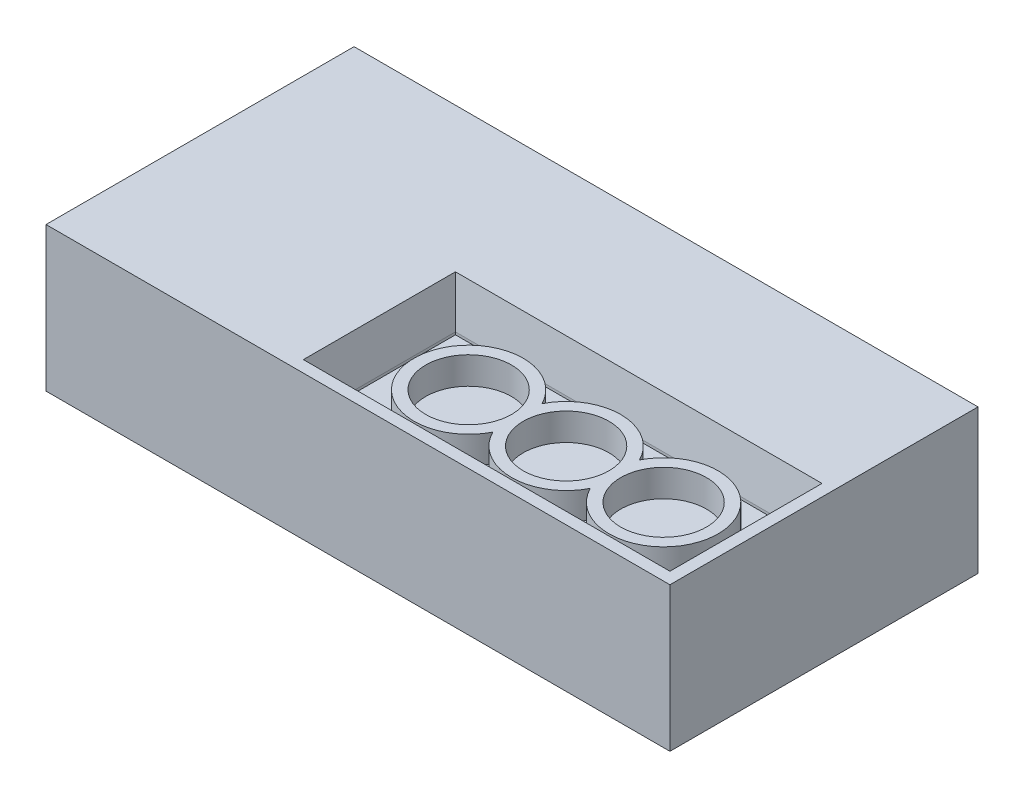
from build123d import *

# Parameters (mm, degrees)
SKETCH1_W           = 160
SKETCH1_H           = 79
BOSS_EXTRUDE1_DEPTH = 37
SKETCH2_W           = 90
SKETCH2_H           = 35
CUT_EXTRUDE2_DEPTH  = 12
SKETCH4_R           = 11
BOSS_EXTRUDE2_DEPTH = 7
CHAMFER1_SIZE       = 2
CHAMFER1_SIZE2      = 11.342563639


with BuildPart() as part:
    # Sketch1 → Boss-Extrude1 (new body)
    with BuildSketch(Plane(origin=(0, 0, 0), x_dir=(1, 0, 0), z_dir=(0, 1, 0))):
        Rectangle(SKETCH1_W, SKETCH1_H)
    extrude(amount=BOSS_EXTRUDE1_DEPTH)

    # Sketch2 → Cut-Extrude2 (cut)
    with BuildSketch(Plane(origin=(0, 37, 0), x_dir=(1, 0, 0), z_dir=(0, 1, 0))):
        with Locations((30, -17)):
            Rectangle(SKETCH2_W, SKETCH2_H)
    extrude(amount=-CUT_EXTRUDE2_DEPTH, mode=Mode.SUBTRACT)

    # Sketch4 → Boss-Extrude2 (add)
    with BuildSketch(Plane(origin=(0, 25, 0), x_dir=(1, 0, 0), z_dir=(0, 1, 0))):
        with BuildLine():
            ThreePointArc((43.381238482, -23.304760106), (69.881238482, -17), (43.381238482, -10.695239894))
            ThreePointArc((43.381238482, -10.695239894), (30.881238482, -3), (18.381238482, -10.695239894))
            ThreePointArc((18.381238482, -10.695239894), (-8.118761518, -17), (18.381238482, -23.304760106))
            ThreePointArc((18.381238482, -23.304760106), (30.881238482, -31), (43.381238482, -23.304760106))
        make_face()
        with Locations(Location((55.881238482, -17, 0), (0, 0, 270))):
            Circle(SKETCH4_R, mode=Mode.SUBTRACT)
        with Locations(Location((30.881238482, -17, 0), (0, 0, 270))):
            Circle(SKETCH4_R, mode=Mode.SUBTRACT)
        with Locations(Location((5.881238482, -17, 0), (0, 0, 270))):
            Circle(SKETCH4_R, mode=Mode.SUBTRACT)
    extrude(amount=BOSS_EXTRUDE2_DEPTH)

    # Chamfer1
    chamfer1_edges = [part.edges().sort_by_distance(p)[0] for p in [
        (75, 37, 17),
        (30, 37, -0.5),
        (-15, 37, 17),
        (30, 37, 34.5),
    ]]
    chamfer1_side = [part.faces().sort_by_distance(p)[0] for p in [
        (-9.957850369, 37, -5.642781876),
    ]]
    chamfer(chamfer1_edges, length=CHAMFER1_SIZE, length2=CHAMFER1_SIZE2, reference=chamfer1_side[0])


solid = part.part
